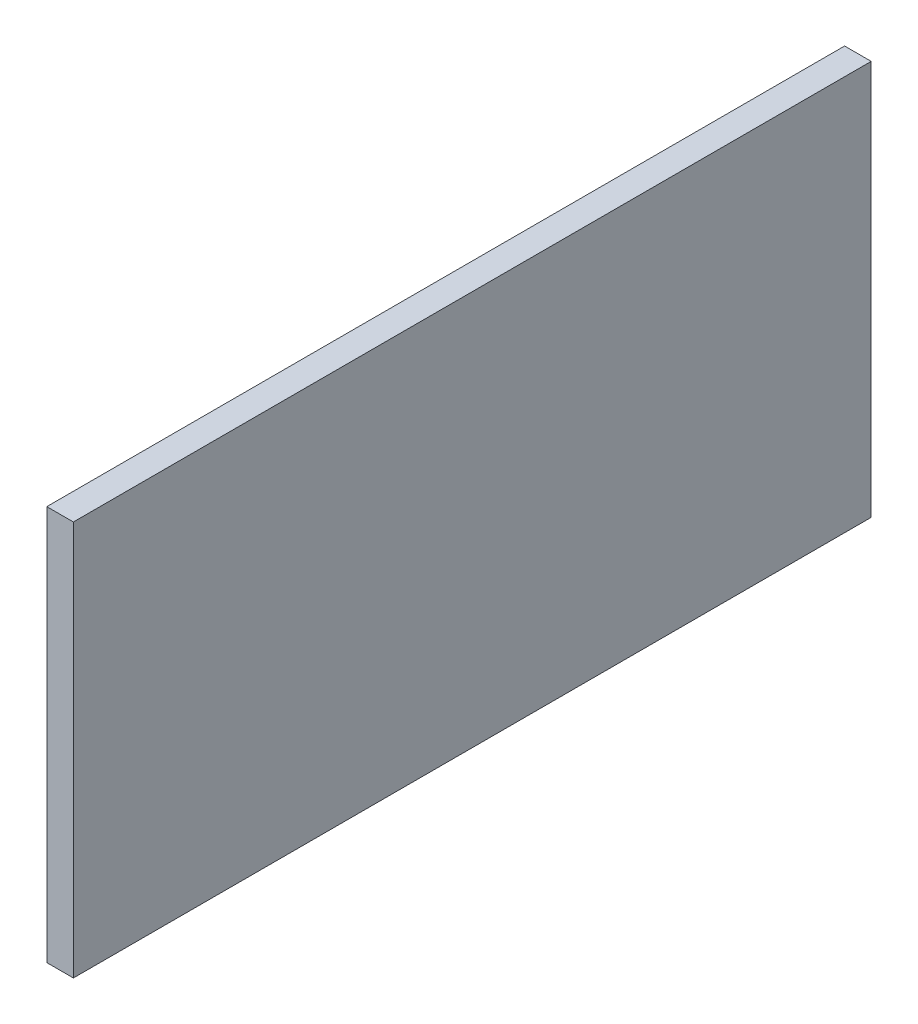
ISO-10303-21;
HEADER;
FILE_DESCRIPTION(('STEP AP214'),'2;1');
FILE_NAME('part.step','',(''),(''),'','','');
FILE_SCHEMA(('AUTOMOTIVE_DESIGN { 1 0 10303 214 1 1 1 1 }'));
ENDSEC;
DATA;
#1=APPLICATION_CONTEXT('core data for automotive mechanical design processes');
#2=APPLICATION_PROTOCOL_DEFINITION('international standard','automotive_design',2000,#1);
#3=PRODUCT_CONTEXT('',#1,'mechanical');
#4=PRODUCT('Part','Part','',(#3));
#5=PRODUCT_RELATED_PRODUCT_CATEGORY('part','',(#4));
#6=PRODUCT_DEFINITION_FORMATION('','',#4);
#7=PRODUCT_DEFINITION_CONTEXT('part definition',#1,'design');
#8=PRODUCT_DEFINITION('design','',#6,#7);
#9=PRODUCT_DEFINITION_SHAPE('','',#8);
#10=(LENGTH_UNIT() NAMED_UNIT(*) SI_UNIT(.MILLI.,.METRE.));
#11=(NAMED_UNIT(*) PLANE_ANGLE_UNIT() SI_UNIT($,.RADIAN.));
#12=(NAMED_UNIT(*) SI_UNIT($,.STERADIAN.) SOLID_ANGLE_UNIT());
#13=UNCERTAINTY_MEASURE_WITH_UNIT(LENGTH_MEASURE(1.E-05),#10,'distance_accuracy_value','');
#14=(GEOMETRIC_REPRESENTATION_CONTEXT(3) GLOBAL_UNCERTAINTY_ASSIGNED_CONTEXT((#13)) GLOBAL_UNIT_ASSIGNED_CONTEXT((#10,
#11,#12)) REPRESENTATION_CONTEXT('',''));
#15=CARTESIAN_POINT('',(0.,0.,0.));
#16=DIRECTION('',(0.,0.,1.));
#17=DIRECTION('',(1.,0.,0.));
#18=AXIS2_PLACEMENT_3D('',#15,#16,#17);
#19=CARTESIAN_POINT('',(40.,0.,0.));
#20=DIRECTION('',(0.,0.,-1.));
#21=DIRECTION('',(-1.,0.,0.));
#22=AXIS2_PLACEMENT_3D('',#19,#20,#21);
#23=PLANE('',#22);
#24=DIRECTION('',(0.,-1.,0.));
#25=VECTOR('',#24,1.);
#26=CARTESIAN_POINT('',(0.,0.,0.));
#27=LINE('',#26,#25);
#28=CARTESIAN_POINT('',(0.,594.,0.));
#29=VERTEX_POINT('',#28);
#30=CARTESIAN_POINT('',(0.,0.,0.));
#31=VERTEX_POINT('',#30);
#32=EDGE_CURVE('E113',#29,#31,#27,.T.);
#33=ORIENTED_EDGE('',*,*,#32,.T.);
#34=DIRECTION('',(-1.,0.,0.));
#35=VECTOR('',#34,1.);
#36=CARTESIAN_POINT('',(40.,0.,0.));
#37=LINE('',#36,#35);
#38=CARTESIAN_POINT('',(40.,0.,0.));
#39=VERTEX_POINT('',#38);
#40=EDGE_CURVE('E11',#39,#31,#37,.T.);
#41=ORIENTED_EDGE('',*,*,#40,.F.);
#42=DIRECTION('',(0.,-1.,0.));
#43=VECTOR('',#42,1.);
#44=CARTESIAN_POINT('',(40.,0.,0.));
#45=LINE('',#44,#43);
#46=CARTESIAN_POINT('',(40.,594.,0.));
#47=VERTEX_POINT('',#46);
#48=EDGE_CURVE('E97',#47,#39,#45,.T.);
#49=ORIENTED_EDGE('',*,*,#48,.F.);
#50=DIRECTION('',(-1.,0.,0.));
#51=VECTOR('',#50,1.);
#52=CARTESIAN_POINT('',(40.,594.,0.));
#53=LINE('',#52,#51);
#54=EDGE_CURVE('E109',#47,#29,#53,.T.);
#55=ORIENTED_EDGE('',*,*,#54,.T.);
#56=EDGE_LOOP('',(#33,#41,#49,#55));
#57=FACE_BOUND('',#56,.T.);
#58=ADVANCED_FACE('F45',(#57),#23,.F.);
#59=CARTESIAN_POINT('',(40.,0.,0.));
#60=DIRECTION('',(0.,1.,0.));
#61=DIRECTION('',(0.,0.,1.));
#62=AXIS2_PLACEMENT_3D('',#59,#60,#61);
#63=PLANE('',#62);
#64=DIRECTION('',(0.,0.,-1.));
#65=VECTOR('',#64,1.);
#66=CARTESIAN_POINT('',(0.,0.,0.));
#67=LINE('',#66,#65);
#68=CARTESIAN_POINT('',(0.,0.,-1200.));
#69=VERTEX_POINT('',#68);
#70=EDGE_CURVE('E102',#31,#69,#67,.T.);
#71=ORIENTED_EDGE('',*,*,#70,.T.);
#72=DIRECTION('',(-1.,0.,0.));
#73=VECTOR('',#72,1.);
#74=CARTESIAN_POINT('',(40.,0.,-1200.));
#75=LINE('',#74,#73);
#76=CARTESIAN_POINT('',(40.,0.,-1200.));
#77=VERTEX_POINT('',#76);
#78=EDGE_CURVE('E54',#77,#69,#75,.T.);
#79=ORIENTED_EDGE('',*,*,#78,.F.);
#80=DIRECTION('',(0.,0.,-1.));
#81=VECTOR('',#80,1.);
#82=CARTESIAN_POINT('',(40.,0.,0.));
#83=LINE('',#82,#81);
#84=EDGE_CURVE('E92',#39,#77,#83,.T.);
#85=ORIENTED_EDGE('',*,*,#84,.F.);
#86=ORIENTED_EDGE('',*,*,#40,.T.);
#87=EDGE_LOOP('',(#71,#79,#85,#86));
#88=FACE_BOUND('',#87,.T.);
#89=ADVANCED_FACE('F101',(#88),#63,.F.);
#90=CARTESIAN_POINT('',(40.,0.,-1200.));
#91=DIRECTION('',(0.,0.,1.));
#92=DIRECTION('',(1.,0.,0.));
#93=AXIS2_PLACEMENT_3D('',#90,#91,#92);
#94=PLANE('',#93);
#95=DIRECTION('',(0.,1.,0.));
#96=VECTOR('',#95,1.);
#97=CARTESIAN_POINT('',(0.,0.,-1200.));
#98=LINE('',#97,#96);
#99=CARTESIAN_POINT('',(0.,594.,-1200.));
#100=VERTEX_POINT('',#99);
#101=EDGE_CURVE('E79',#69,#100,#98,.T.);
#102=ORIENTED_EDGE('',*,*,#101,.T.);
#103=DIRECTION('',(-1.,0.,0.));
#104=VECTOR('',#103,1.);
#105=CARTESIAN_POINT('',(40.,594.,-1200.));
#106=LINE('',#105,#104);
#107=CARTESIAN_POINT('',(40.,594.,-1200.));
#108=VERTEX_POINT('',#107);
#109=EDGE_CURVE('E104',#108,#100,#106,.T.);
#110=ORIENTED_EDGE('',*,*,#109,.F.);
#111=DIRECTION('',(0.,1.,0.));
#112=VECTOR('',#111,1.);
#113=CARTESIAN_POINT('',(40.,0.,-1200.));
#114=LINE('',#113,#112);
#115=EDGE_CURVE('E95',#77,#108,#114,.T.);
#116=ORIENTED_EDGE('',*,*,#115,.F.);
#117=ORIENTED_EDGE('',*,*,#78,.T.);
#118=EDGE_LOOP('',(#102,#110,#116,#117));
#119=FACE_BOUND('',#118,.T.);
#120=ADVANCED_FACE('F105',(#119),#94,.F.);
#121=CARTESIAN_POINT('',(40.,594.,0.));
#122=DIRECTION('',(0.,-1.,0.));
#123=DIRECTION('',(0.,0.,-1.));
#124=AXIS2_PLACEMENT_3D('',#121,#122,#123);
#125=PLANE('',#124);
#126=DIRECTION('',(0.,0.,1.));
#127=VECTOR('',#126,1.);
#128=CARTESIAN_POINT('',(0.,594.,0.));
#129=LINE('',#128,#127);
#130=EDGE_CURVE('E85',#100,#29,#129,.T.);
#131=ORIENTED_EDGE('',*,*,#130,.T.);
#132=ORIENTED_EDGE('',*,*,#54,.F.);
#133=DIRECTION('',(0.,0.,1.));
#134=VECTOR('',#133,1.);
#135=CARTESIAN_POINT('',(40.,594.,0.));
#136=LINE('',#135,#134);
#137=EDGE_CURVE('E62',#108,#47,#136,.T.);
#138=ORIENTED_EDGE('',*,*,#137,.F.);
#139=ORIENTED_EDGE('',*,*,#109,.T.);
#140=EDGE_LOOP('',(#131,#132,#138,#139));
#141=FACE_BOUND('',#140,.T.);
#142=ADVANCED_FACE('F126',(#141),#125,.F.);
#143=CARTESIAN_POINT('',(40.,0.,0.));
#144=DIRECTION('',(-1.,0.,0.));
#145=DIRECTION('',(0.,0.,1.));
#146=AXIS2_PLACEMENT_3D('',#143,#144,#145);
#147=PLANE('',#146);
#148=ORIENTED_EDGE('',*,*,#48,.T.);
#149=ORIENTED_EDGE('',*,*,#84,.T.);
#150=ORIENTED_EDGE('',*,*,#115,.T.);
#151=ORIENTED_EDGE('',*,*,#137,.T.);
#152=EDGE_LOOP('',(#148,#149,#150,#151));
#153=FACE_BOUND('',#152,.T.);
#154=ADVANCED_FACE('F93',(#153),#147,.F.);
#155=CARTESIAN_POINT('',(0.,0.,0.));
#156=DIRECTION('',(-1.,0.,0.));
#157=DIRECTION('',(0.,0.,1.));
#158=AXIS2_PLACEMENT_3D('',#155,#156,#157);
#159=PLANE('',#158);
#160=ORIENTED_EDGE('',*,*,#32,.F.);
#161=ORIENTED_EDGE('',*,*,#130,.F.);
#162=ORIENTED_EDGE('',*,*,#101,.F.);
#163=ORIENTED_EDGE('',*,*,#70,.F.);
#164=EDGE_LOOP('',(#160,#161,#162,#163));
#165=FACE_BOUND('',#164,.T.);
#166=ADVANCED_FACE('F129',(#165),#159,.T.);
#167=CLOSED_SHELL('',(#58,#89,#120,#142,#154,#166));
#168=MANIFOLD_SOLID_BREP('B2',#167);
#169=ADVANCED_BREP_SHAPE_REPRESENTATION('',(#18,#168),#14);
#170=SHAPE_DEFINITION_REPRESENTATION(#9,#169);
ENDSEC;
END-ISO-10303-21;
